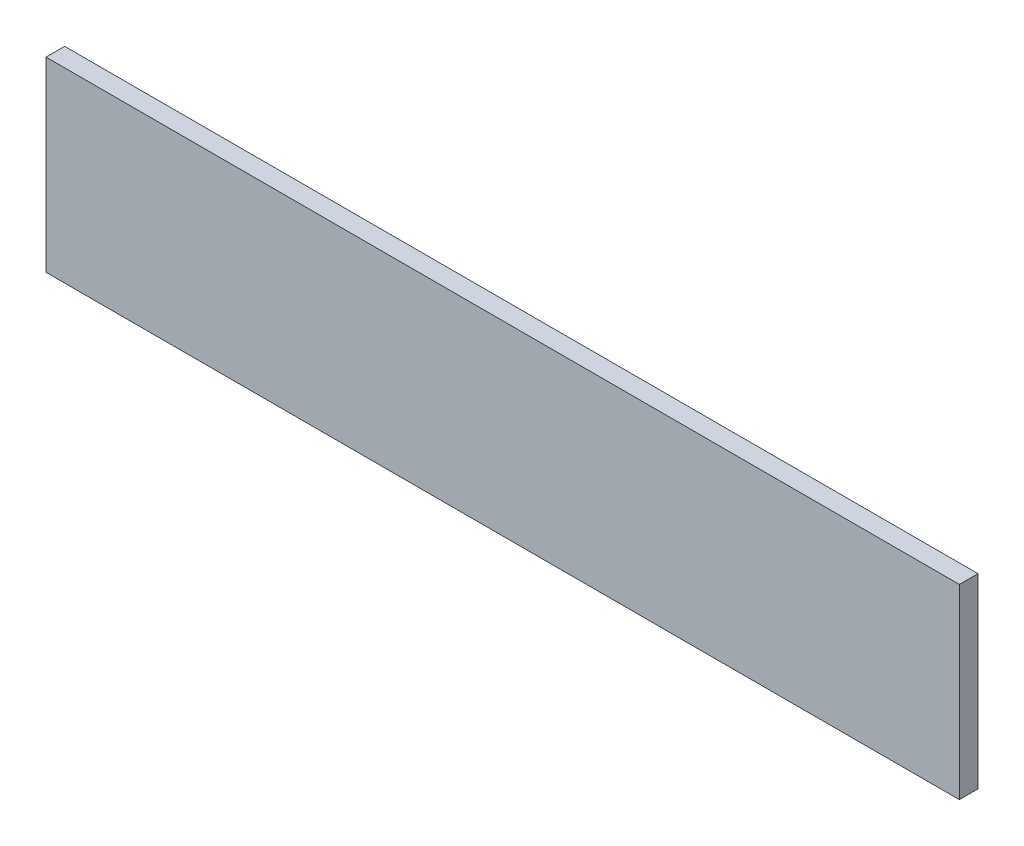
from build123d import *

# Parameters (mm, degrees)
SKETCH1_W           = 490
SKETCH1_H           = 100
BOSS_EXTRUDE1_DEPTH = 10


with BuildPart() as part:
    # Sketch1 → Boss-Extrude1 (new body)
    with BuildSketch(Plane.XY):
        Rectangle(SKETCH1_W, SKETCH1_H)
    extrude(amount=BOSS_EXTRUDE1_DEPTH)


solid = part.part
